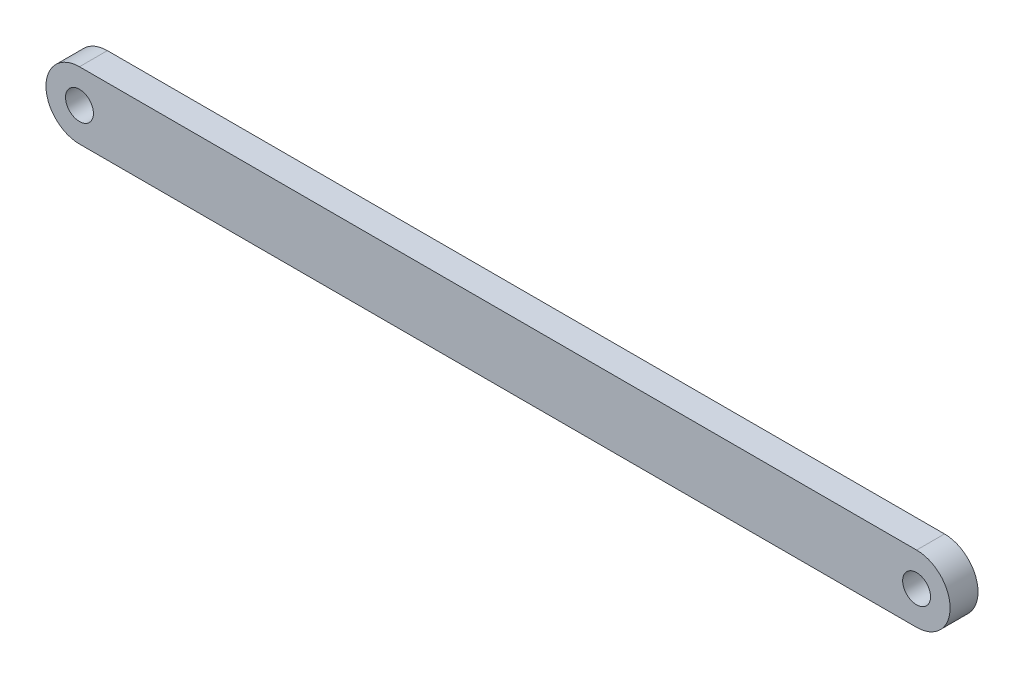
from build123d import *

# Parameters (mm, degrees)
CROQUIS1_R              = 2.5
SALIENTE_EXTRUIR1_DEPTH = 2.5


with BuildPart() as part:
    # Croquis1 → Saliente-Extruir1 (new, symmetric)
    with BuildSketch(Plane.XY):
        with BuildLine():
            Line((-75, 6), (75, 6))
            ThreePointArc((75, 6), (81, 0), (75, -6))
            Line((75, -6), (-75, -6))
            ThreePointArc((-75, -6), (-81, 0), (-75, 6))
        make_face()
        with Locations((75, 0)):
            Circle(CROQUIS1_R, mode=Mode.SUBTRACT)
        with Locations((-75, 0)):
            Circle(CROQUIS1_R, mode=Mode.SUBTRACT)
    extrude(amount=SALIENTE_EXTRUIR1_DEPTH, both=True)


solid = part.part
